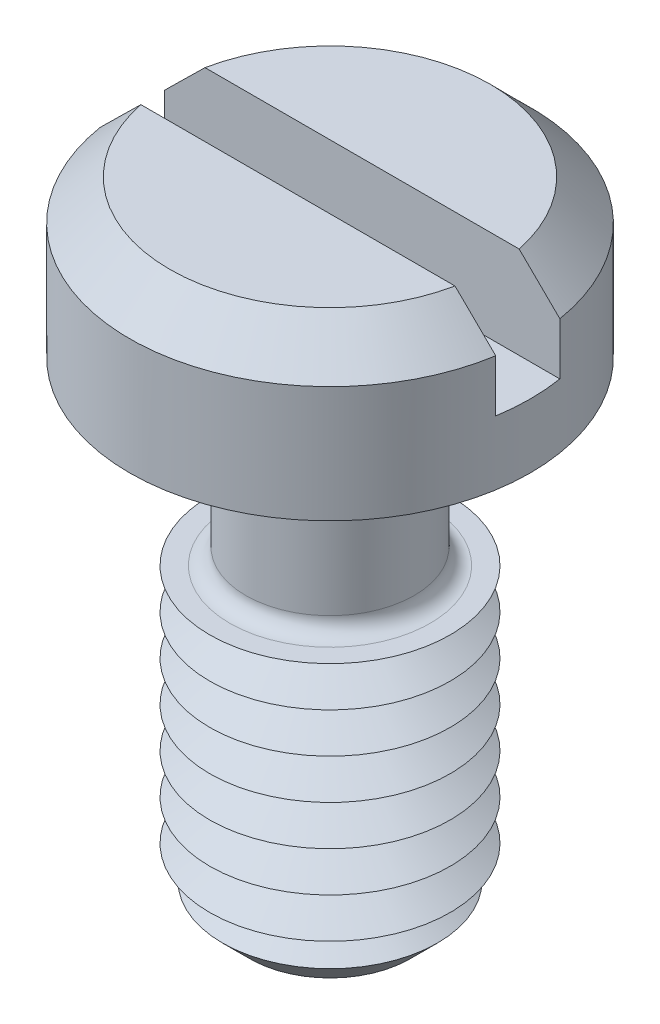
ISO-10303-21;
HEADER;
FILE_DESCRIPTION(('STEP AP214'),'2;1');
FILE_NAME('part.step','',(''),(''),'','','');
FILE_SCHEMA(('AUTOMOTIVE_DESIGN { 1 0 10303 214 1 1 1 1 }'));
ENDSEC;
DATA;
#1=APPLICATION_CONTEXT('core data for automotive mechanical design processes');
#2=APPLICATION_PROTOCOL_DEFINITION('international standard','automotive_design',2000,#1);
#3=PRODUCT_CONTEXT('',#1,'mechanical');
#4=PRODUCT('Part','Part','',(#3));
#5=PRODUCT_RELATED_PRODUCT_CATEGORY('part','',(#4));
#6=PRODUCT_DEFINITION_FORMATION('','',#4);
#7=PRODUCT_DEFINITION_CONTEXT('part definition',#1,'design');
#8=PRODUCT_DEFINITION('design','',#6,#7);
#9=PRODUCT_DEFINITION_SHAPE('','',#8);
#10=(LENGTH_UNIT() NAMED_UNIT(*) SI_UNIT(.MILLI.,.METRE.));
#11=(NAMED_UNIT(*) PLANE_ANGLE_UNIT() SI_UNIT($,.RADIAN.));
#12=(NAMED_UNIT(*) SI_UNIT($,.STERADIAN.) SOLID_ANGLE_UNIT());
#13=UNCERTAINTY_MEASURE_WITH_UNIT(LENGTH_MEASURE(1.E-05),#10,'distance_accuracy_value','');
#14=(GEOMETRIC_REPRESENTATION_CONTEXT(3) GLOBAL_UNCERTAINTY_ASSIGNED_CONTEXT((#13)) GLOBAL_UNIT_ASSIGNED_CONTEXT((#10,
#11,#12)) REPRESENTATION_CONTEXT('',''));
#15=CARTESIAN_POINT('',(0.,0.,0.));
#16=DIRECTION('',(0.,0.,1.));
#17=DIRECTION('',(1.,0.,0.));
#18=AXIS2_PLACEMENT_3D('',#15,#16,#17);
#19=CARTESIAN_POINT('',(0.,3.9,0.));
#20=DIRECTION('',(0.,1.,0.));
#21=DIRECTION('',(0.,0.,1.));
#22=AXIS2_PLACEMENT_3D('',#19,#20,#21);
#23=PLANE('',#22);
#24=DIRECTION('',(-1.,0.,0.));
#25=VECTOR('',#24,1.);
#26=CARTESIAN_POINT('',(5.,3.9,-0.8));
#27=LINE('',#26,#25);
#28=CARTESIAN_POINT('',(3.91918358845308,3.9,-0.8));
#29=VERTEX_POINT('',#28);
#30=CARTESIAN_POINT('',(-3.91918358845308,3.9,-0.8));
#31=VERTEX_POINT('',#30);
#32=EDGE_CURVE('E110',#29,#31,#27,.T.);
#33=ORIENTED_EDGE('',*,*,#32,.F.);
#34=CARTESIAN_POINT('',(0.,3.9,0.));
#35=DIRECTION('',(0.,1.,0.));
#36=DIRECTION('',(0.,0.,1.));
#37=AXIS2_PLACEMENT_3D('',#34,#35,#36);
#38=CIRCLE('',#37,4.);
#39=EDGE_CURVE('E113',#29,#31,#38,.T.);
#40=ORIENTED_EDGE('',*,*,#39,.T.);
#41=EDGE_LOOP('',(#33,#40));
#42=FACE_BOUND('',#41,.T.);
#43=ADVANCED_FACE('F39',(#42),#23,.T.);
#44=CARTESIAN_POINT('',(0.,3.9,0.));
#45=DIRECTION('',(0.,-1.,0.));
#46=DIRECTION('',(0.,0.,-1.));
#47=AXIS2_PLACEMENT_3D('',#44,#45,#46);
#48=CONICAL_SURFACE('',#47,4.,0.785398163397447);
#49=CARTESIAN_POINT('',(11.0010756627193,-3.13012537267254,-0.8));
#50=CARTESIAN_POINT('',(10.6180645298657,-2.74813121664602,-0.8));
#51=CARTESIAN_POINT('',(10.2350087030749,-2.36618183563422,-0.8));
#52=CARTESIAN_POINT('',(9.46873746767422,-1.60241986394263,-0.8));
#53=CARTESIAN_POINT('',(9.08552205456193,-1.22060727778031,-0.8));
#54=CARTESIAN_POINT('',(8.31861292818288,-0.456918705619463,-0.8));
#55=CARTESIAN_POINT('',(7.93491906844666,-0.0750428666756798,-0.8));
#56=CARTESIAN_POINT('',(7.16722555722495,0.688378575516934,-0.8));
#57=CARTESIAN_POINT('',(6.78322591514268,1.06992418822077,-0.8));
#58=CARTESIAN_POINT('',(6.01856215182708,1.82868912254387,-0.8));
#59=CARTESIAN_POINT('',(5.63790309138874,2.20591354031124,-0.8));
#60=CARTESIAN_POINT('',(5.06622054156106,2.7710831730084,-0.8));
#61=CARTESIAN_POINT('',(4.87553531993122,2.9593704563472,-0.8));
#62=CARTESIAN_POINT('',(4.49384424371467,3.33561647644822,-0.8));
#63=CARTESIAN_POINT('',(4.302838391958,3.52357521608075,-0.8));
#64=CARTESIAN_POINT('',(3.92044271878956,3.89893397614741,-0.8));
#65=CARTESIAN_POINT('',(3.7290531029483,4.08633420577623,-0.8));
#66=CARTESIAN_POINT('',(3.34554223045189,4.46039762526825,-0.8));
#67=CARTESIAN_POINT('',(3.15342094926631,4.64706078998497,-0.8));
#68=CARTESIAN_POINT('',(2.76802565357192,5.01913697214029,-0.8));
#69=CARTESIAN_POINT('',(2.57475182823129,5.20455018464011,-0.8));
#70=CARTESIAN_POINT('',(2.28318236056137,5.4809110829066,-0.8));
#71=CARTESIAN_POINT('',(2.1857187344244,5.57273577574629,-0.8));
#72=CARTESIAN_POINT('',(1.98998431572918,5.75552004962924,-0.8));
#73=CARTESIAN_POINT('',(1.89171354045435,5.84647964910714,-0.8));
#74=CARTESIAN_POINT('',(1.76578543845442,5.96147491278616,-0.8));
#75=CARTESIAN_POINT('',(1.73869031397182,5.98612635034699,-0.8));
#76=CARTESIAN_POINT('',(1.68439529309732,6.0353137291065,-0.8));
#77=CARTESIAN_POINT('',(1.65719539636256,6.05984966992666,-0.8));
#78=CARTESIAN_POINT('',(1.57541627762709,6.13326356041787,-0.8));
#79=CARTESIAN_POINT('',(1.52066027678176,6.18194515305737,-0.8));
#80=CARTESIAN_POINT('',(1.41038257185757,6.27874171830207,-0.8));
#81=CARTESIAN_POINT('',(1.35485918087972,6.32685477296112,-0.8));
#82=CARTESIAN_POINT('',(1.24299231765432,6.42210730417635,-0.8));
#83=CARTESIAN_POINT('',(1.18664895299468,6.46924690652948,-0.8));
#84=CARTESIAN_POINT('',(1.07845249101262,6.55754663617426,-0.8));
#85=CARTESIAN_POINT('',(1.02670624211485,6.59883713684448,-0.8));
#86=CARTESIAN_POINT('',(0.921961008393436,6.67979338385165,-0.8));
#87=CARTESIAN_POINT('',(0.868962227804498,6.71945939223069,-0.8));
#88=CARTESIAN_POINT('',(0.761295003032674,6.79630361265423,-0.8));
#89=CARTESIAN_POINT('',(0.706629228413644,6.83348552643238,-0.8));
#90=CARTESIAN_POINT('',(0.594896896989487,6.90399895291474,-0.8));
#91=CARTESIAN_POINT('',(0.5378333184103,6.93733506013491,-0.8));
#92=CARTESIAN_POINT('',(0.428390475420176,6.99356340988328,-0.8));
#93=CARTESIAN_POINT('',(0.376435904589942,7.01726022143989,-0.8));
#94=CARTESIAN_POINT('',(0.269759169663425,7.05717670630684,-0.8));
#95=CARTESIAN_POINT('',(0.215046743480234,7.07342088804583,-0.8));
#96=CARTESIAN_POINT('',(0.113016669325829,7.09332110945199,-0.8));
#97=CARTESIAN_POINT('',(0.066043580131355,7.09866042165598,-0.8));
#98=CARTESIAN_POINT('',(-0.0280587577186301,7.10088875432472,-0.8));
#99=CARTESIAN_POINT('',(-0.0751877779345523,7.09778705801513,-0.8));
#100=CARTESIAN_POINT('',(-0.180723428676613,7.08192474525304,-0.8));
#101=CARTESIAN_POINT('',(-0.238762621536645,7.06679554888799,-0.8));
#102=CARTESIAN_POINT('',(-0.32349937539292,7.03748409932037,-0.8));
#103=CARTESIAN_POINT('',(-0.351441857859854,7.0265659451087,-0.8));
#104=CARTESIAN_POINT('',(-0.40656991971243,7.00295901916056,-0.8));
#105=CARTESIAN_POINT('',(-0.433755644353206,6.99027059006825,-0.8));
#106=CARTESIAN_POINT('',(-0.504673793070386,6.95489235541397,-0.8));
#107=CARTESIAN_POINT('',(-0.547808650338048,6.93101671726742,-0.8));
#108=CARTESIAN_POINT('',(-0.632566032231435,6.88069648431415,-0.8));
#109=CARTESIAN_POINT('',(-0.674187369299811,6.85424992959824,-0.8));
#110=CARTESIAN_POINT('',(-0.756326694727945,6.79950439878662,-0.8));
#111=CARTESIAN_POINT('',(-0.796841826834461,6.77120117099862,-0.8));
#112=CARTESIAN_POINT('',(-0.876938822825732,6.71329852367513,-0.8));
#113=CARTESIAN_POINT('',(-0.916520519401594,6.68369887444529,-0.8));
#114=CARTESIAN_POINT('',(-1.03465904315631,6.59312324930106,-0.8));
#115=CARTESIAN_POINT('',(-1.11211338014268,6.5307142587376,-0.8));
#116=CARTESIAN_POINT('',(-1.26505454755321,6.40381418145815,-0.8));
#117=CARTESIAN_POINT('',(-1.34054439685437,6.33932667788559,-0.8));
#118=CARTESIAN_POINT('',(-1.48913173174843,6.20997083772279,-0.8));
#119=CARTESIAN_POINT('',(-1.5622481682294,6.14512422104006,-0.8));
#120=CARTESIAN_POINT('',(-1.70765393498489,6.01451044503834,-0.8));
#121=CARTESIAN_POINT('',(-1.77994324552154,5.94874326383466,-0.8));
#122=CARTESIAN_POINT('',(-1.99594639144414,5.75046596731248,-0.8));
#123=CARTESIAN_POINT('',(-2.13877767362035,5.61699583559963,-0.8));
#124=CARTESIAN_POINT('',(-2.42324632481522,5.34853800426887,-0.8));
#125=CARTESIAN_POINT('',(-2.56488247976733,5.21354902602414,-0.8));
#126=CARTESIAN_POINT('',(-2.84730929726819,4.94270932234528,-0.8));
#127=CARTESIAN_POINT('',(-2.98810001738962,4.80685865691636,-0.8));
#128=CARTESIAN_POINT('',(-3.26818763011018,4.53549974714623,-0.8));
#129=CARTESIAN_POINT('',(-3.40748821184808,4.39999530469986,-0.8));
#130=CARTESIAN_POINT('',(-3.68570899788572,4.12859172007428,-0.8));
#131=CARTESIAN_POINT('',(-3.82462919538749,3.99269257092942,-0.8));
#132=CARTESIAN_POINT('',(-4.24087543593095,3.58468153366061,-0.8));
#133=CARTESIAN_POINT('',(-4.51779300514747,3.31215310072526,-0.8));
#134=CARTESIAN_POINT('',(-5.05279381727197,2.78443938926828,-0.8));
#135=CARTESIAN_POINT('',(-5.31091639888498,2.52929393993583,-0.8));
#136=CARTESIAN_POINT('',(-5.82680751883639,2.01864429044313,-0.8));
#137=CARTESIAN_POINT('',(-6.08457605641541,1.76314008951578,-0.8));
#138=CARTESIAN_POINT('',(-6.85760508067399,0.996194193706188,-0.8));
#139=CARTESIAN_POINT('',(-7.37251152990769,0.484395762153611,-0.8));
#140=CARTESIAN_POINT('',(-8.40657233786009,-0.544392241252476,-0.8));
#141=CARTESIAN_POINT('',(-8.92572224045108,-1.06138628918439,-0.8));
#142=CARTESIAN_POINT('',(-9.9636287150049,-2.09560660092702,-0.8));
#143=CARTESIAN_POINT('',(-10.4823853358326,-2.61283281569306,-0.8));
#144=CARTESIAN_POINT('',(-11.0010756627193,-3.13012537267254,-0.8));
#145=B_SPLINE_CURVE_WITH_KNOTS('',3,(#49,#50,#51,#52,#53,#54,#55,#56,#57,#58,#59,#60,#61,#62,
#63,#64,#65,#66,#67,#68,#69,#70,#71,#72,#73,#74,#75,#76,#77,#78,#79,#80,#81,#82,#83,#84,#85,#86,
#87,#88,#89,#90,#91,#92,#93,#94,#95,#96,#97,#98,#99,#100,#101,#102,#103,#104,#105,#106,#107,
#108,#109,#110,#111,#112,#113,#114,#115,#116,#117,#118,#119,#120,#121,#122,#123,#124,#125,#126,
#127,#128,#129,#130,#131,#132,#133,#134,#135,#136,#137,#138,#139,#140,#141,#142,#143,#144),
.UNSPECIFIED.,.F.,.F.,(4,2,2,2,2,2,2,2,2,2,2,2,2,2,2,2,2,2,2,2,2,2,2,2,2,2,2,2,2,2,2,2,2,2,2,2,
2,2,2,2,2,2,2,2,2,2,2,4),(0.,1.62282275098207,3.24569489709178,4.86971791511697,
6.49369278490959,8.10142191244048,8.90535980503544,9.7092906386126,10.5128682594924,
11.3164730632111,12.1199494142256,12.5216659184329,12.9233738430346,13.0332669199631,
13.1431603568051,13.3629580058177,13.5833578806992,13.8037290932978,14.0023112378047,
14.2008612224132,14.3991084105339,14.5971162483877,14.7680800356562,14.9384774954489,
15.0795987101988,15.2205647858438,15.3993585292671,15.4893211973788,15.579266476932,
15.727032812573,15.8749126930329,16.0231439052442,16.1714014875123,16.4697244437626,
16.767558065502,17.0607348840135,17.35391868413,17.9403574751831,18.5273336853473,
19.1142694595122,19.6972736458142,20.2802881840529,21.4458742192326,22.5346981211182,
23.6235243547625,25.8015035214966,27.9995014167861,30.1971550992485),.UNSPECIFIED.);
#146=CARTESIAN_POINT('',(4.93558507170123,2.9,-0.8));
#147=VERTEX_POINT('',#146);
#148=EDGE_CURVE('E250',#147,#29,#145,.T.);
#149=ORIENTED_EDGE('',*,*,#148,.F.);
#150=CARTESIAN_POINT('',(0.,2.9,0.));
#151=DIRECTION('',(0.,1.,0.));
#152=DIRECTION('',(0.,0.,1.));
#153=AXIS2_PLACEMENT_3D('',#150,#151,#152);
#154=CIRCLE('',#153,5.);
#155=CARTESIAN_POINT('',(-4.93558507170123,2.9,-0.8));
#156=VERTEX_POINT('',#155);
#157=EDGE_CURVE('E126',#156,#147,#154,.F.);
#158=ORIENTED_EDGE('',*,*,#157,.F.);
#159=EDGE_CURVE('E102',#31,#156,#145,.T.);
#160=ORIENTED_EDGE('',*,*,#159,.F.);
#161=ORIENTED_EDGE('',*,*,#39,.F.);
#162=EDGE_LOOP('',(#149,#158,#160,#161));
#163=FACE_BOUND('',#162,.T.);
#164=ADVANCED_FACE('F212',(#163),#48,.T.);
#165=CARTESIAN_POINT('',(0.,-12.,0.));
#166=DIRECTION('',(0.,1.,0.));
#167=DIRECTION('',(0.,0.,1.));
#168=AXIS2_PLACEMENT_3D('',#165,#166,#167);
#169=CYLINDRICAL_SURFACE('',#168,2.1);
#170=CARTESIAN_POINT('',(0.,-4.1,0.));
#171=DIRECTION('',(0.,-1.,0.));
#172=DIRECTION('',(0.,0.,-1.));
#173=AXIS2_PLACEMENT_3D('',#170,#171,#172);
#174=CIRCLE('',#173,2.1);
#175=CARTESIAN_POINT('',(0.,-4.1,-2.1));
#176=VERTEX_POINT('',#175);
#177=EDGE_CURVE('E121',#176,#176,#174,.F.);
#178=ORIENTED_EDGE('',*,*,#177,.T.);
#179=EDGE_LOOP('',(#178));
#180=FACE_BOUND('',#179,.T.);
#181=CARTESIAN_POINT('',(0.,-0.399999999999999,0.));
#182=DIRECTION('',(0.,1.,0.));
#183=DIRECTION('',(0.,0.,1.));
#184=AXIS2_PLACEMENT_3D('',#181,#182,#183);
#185=CIRCLE('',#184,2.1);
#186=CARTESIAN_POINT('',(0.,-0.399999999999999,2.1));
#187=VERTEX_POINT('',#186);
#188=EDGE_CURVE('E349',#187,#187,#185,.F.);
#189=ORIENTED_EDGE('',*,*,#188,.T.);
#190=EDGE_LOOP('',(#189));
#191=FACE_BOUND('',#190,.T.);
#192=ADVANCED_FACE('F208',(#180,#191),#169,.T.);
#193=CARTESIAN_POINT('',(0.,3.9,0.));
#194=DIRECTION('',(0.,-1.,0.));
#195=DIRECTION('',(0.,0.,-1.));
#196=AXIS2_PLACEMENT_3D('',#193,#194,#195);
#197=CYLINDRICAL_SURFACE('',#196,5.);
#198=ORIENTED_EDGE('',*,*,#157,.T.);
#199=DIRECTION('',(0.,-1.,0.));
#200=VECTOR('',#199,1.);
#201=CARTESIAN_POINT('',(4.93558507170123,3.9,-0.8));
#202=LINE('',#201,#200);
#203=CARTESIAN_POINT('',(4.93558507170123,1.6,-0.8));
#204=VERTEX_POINT('',#203);
#205=EDGE_CURVE('E64',#147,#204,#202,.T.);
#206=ORIENTED_EDGE('',*,*,#205,.T.);
#207=CARTESIAN_POINT('',(0.,1.6,0.));
#208=DIRECTION('',(0.,1.,0.));
#209=DIRECTION('',(0.,0.,1.));
#210=AXIS2_PLACEMENT_3D('',#207,#208,#209);
#211=CIRCLE('',#210,5.);
#212=CARTESIAN_POINT('',(4.93558507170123,1.6,0.8));
#213=VERTEX_POINT('',#212);
#214=EDGE_CURVE('E11',#213,#204,#211,.T.);
#215=ORIENTED_EDGE('',*,*,#214,.F.);
#216=DIRECTION('',(0.,-1.,0.));
#217=VECTOR('',#216,1.);
#218=CARTESIAN_POINT('',(4.93558507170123,3.9,0.8));
#219=LINE('',#218,#217);
#220=CARTESIAN_POINT('',(4.93558507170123,2.9,0.8));
#221=VERTEX_POINT('',#220);
#222=EDGE_CURVE('E269',#213,#221,#219,.F.);
#223=ORIENTED_EDGE('',*,*,#222,.T.);
#224=CARTESIAN_POINT('',(-4.93558507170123,2.9,0.8));
#225=VERTEX_POINT('',#224);
#226=EDGE_CURVE('E119',#221,#225,#154,.F.);
#227=ORIENTED_EDGE('',*,*,#226,.T.);
#228=DIRECTION('',(0.,-1.,0.));
#229=VECTOR('',#228,1.);
#230=CARTESIAN_POINT('',(-4.93558507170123,3.9,0.8));
#231=LINE('',#230,#229);
#232=CARTESIAN_POINT('',(-4.93558507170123,1.6,0.8));
#233=VERTEX_POINT('',#232);
#234=EDGE_CURVE('E96',#225,#233,#231,.T.);
#235=ORIENTED_EDGE('',*,*,#234,.T.);
#236=CARTESIAN_POINT('',(-4.93558507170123,1.6,-0.8));
#237=VERTEX_POINT('',#236);
#238=EDGE_CURVE('E44',#237,#233,#211,.T.);
#239=ORIENTED_EDGE('',*,*,#238,.F.);
#240=DIRECTION('',(0.,-1.,0.));
#241=VECTOR('',#240,1.);
#242=CARTESIAN_POINT('',(-4.93558507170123,3.9,-0.8));
#243=LINE('',#242,#241);
#244=EDGE_CURVE('E274',#237,#156,#243,.F.);
#245=ORIENTED_EDGE('',*,*,#244,.T.);
#246=EDGE_LOOP('',(#198,#206,#215,#223,#227,#235,#239,#245));
#247=FACE_BOUND('',#246,.T.);
#248=CARTESIAN_POINT('',(0.,0.,0.));
#249=DIRECTION('',(0.,1.,0.));
#250=DIRECTION('',(0.,0.,1.));
#251=AXIS2_PLACEMENT_3D('',#248,#249,#250);
#252=CIRCLE('',#251,5.);
#253=CARTESIAN_POINT('',(0.,0.,5.));
#254=VERTEX_POINT('',#253);
#255=EDGE_CURVE('E335',#254,#254,#252,.T.);
#256=ORIENTED_EDGE('',*,*,#255,.T.);
#257=EDGE_LOOP('',(#256));
#258=FACE_BOUND('',#257,.T.);
#259=ADVANCED_FACE('F211',(#247,#258),#197,.T.);
#260=DIRECTION('',(1.,0.,0.));
#261=VECTOR('',#260,1.);
#262=CARTESIAN_POINT('',(5.,3.9,0.8));
#263=LINE('',#262,#261);
#264=CARTESIAN_POINT('',(-3.91918358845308,3.9,0.8));
#265=VERTEX_POINT('',#264);
#266=CARTESIAN_POINT('',(3.91918358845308,3.9,0.8));
#267=VERTEX_POINT('',#266);
#268=EDGE_CURVE('E56',#265,#267,#263,.T.);
#269=ORIENTED_EDGE('',*,*,#268,.F.);
#270=EDGE_CURVE('E108',#265,#267,#38,.T.);
#271=ORIENTED_EDGE('',*,*,#270,.T.);
#272=EDGE_LOOP('',(#269,#271));
#273=FACE_BOUND('',#272,.T.);
#274=ADVANCED_FACE('F107',(#273),#23,.T.);
#275=CARTESIAN_POINT('',(0.,0.,0.));
#276=DIRECTION('',(0.,1.,0.));
#277=DIRECTION('',(0.,0.,1.));
#278=AXIS2_PLACEMENT_3D('',#275,#276,#277);
#279=PLANE('',#278);
#280=CARTESIAN_POINT('',(0.,0.,0.));
#281=DIRECTION('',(0.,1.,0.));
#282=DIRECTION('',(0.,0.,1.));
#283=AXIS2_PLACEMENT_3D('',#280,#281,#282);
#284=CIRCLE('',#283,2.5);
#285=CARTESIAN_POINT('',(0.,0.,2.5));
#286=VERTEX_POINT('',#285);
#287=EDGE_CURVE('E114',#286,#286,#284,.T.);
#288=ORIENTED_EDGE('',*,*,#287,.T.);
#289=EDGE_LOOP('',(#288));
#290=FACE_BOUND('',#289,.T.);
#291=ORIENTED_EDGE('',*,*,#255,.F.);
#292=EDGE_LOOP('',(#291));
#293=FACE_BOUND('',#292,.T.);
#294=ADVANCED_FACE('F202',(#290,#293),#279,.F.);
#295=CARTESIAN_POINT('',(0.,-4.5,0.));
#296=DIRECTION('',(0.,-1.,0.));
#297=DIRECTION('',(0.,0.,-1.));
#298=AXIS2_PLACEMENT_3D('',#295,#296,#297);
#299=PLANE('',#298);
#300=CARTESIAN_POINT('',(0.,-4.5,0.));
#301=DIRECTION('',(0.,-1.,0.));
#302=DIRECTION('',(0.,0.,-1.));
#303=AXIS2_PLACEMENT_3D('',#300,#301,#302);
#304=CIRCLE('',#303,2.5);
#305=CARTESIAN_POINT('',(0.,-4.5,-2.5));
#306=VERTEX_POINT('',#305);
#307=EDGE_CURVE('E343',#306,#306,#304,.T.);
#308=ORIENTED_EDGE('',*,*,#307,.T.);
#309=EDGE_LOOP('',(#308));
#310=FACE_BOUND('',#309,.T.);
#311=CARTESIAN_POINT('',(0.,-4.5,0.));
#312=DIRECTION('',(0.,1.,0.));
#313=DIRECTION('',(0.,0.,1.));
#314=AXIS2_PLACEMENT_3D('',#311,#312,#313);
#315=CIRCLE('',#314,3.);
#316=CARTESIAN_POINT('',(0.,-4.5,3.));
#317=VERTEX_POINT('',#316);
#318=EDGE_CURVE('E331',#317,#317,#315,.T.);
#319=ORIENTED_EDGE('',*,*,#318,.T.);
#320=EDGE_LOOP('',(#319));
#321=FACE_BOUND('',#320,.T.);
#322=ADVANCED_FACE('F198',(#310,#321),#299,.F.);
#323=CARTESIAN_POINT('',(0.,-5.,0.));
#324=DIRECTION('',(0.,1.,0.));
#325=DIRECTION('',(0.,0.,1.));
#326=AXIS2_PLACEMENT_3D('',#323,#324,#325);
#327=CONICAL_SURFACE('',#326,2.13397459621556,1.0471975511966);
#328=ORIENTED_EDGE('',*,*,#318,.F.);
#329=EDGE_LOOP('',(#328));
#330=FACE_BOUND('',#329,.T.);
#331=CARTESIAN_POINT('',(0.,-5.,0.));
#332=DIRECTION('',(0.,1.,0.));
#333=DIRECTION('',(0.,0.,1.));
#334=AXIS2_PLACEMENT_3D('',#331,#332,#333);
#335=CIRCLE('',#334,2.13397459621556);
#336=CARTESIAN_POINT('',(0.,-5.,2.13397459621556));
#337=VERTEX_POINT('',#336);
#338=EDGE_CURVE('E327',#337,#337,#335,.T.);
#339=ORIENTED_EDGE('',*,*,#338,.T.);
#340=EDGE_LOOP('',(#339));
#341=FACE_BOUND('',#340,.T.);
#342=ADVANCED_FACE('F194',(#330,#341),#327,.T.);
#343=CARTESIAN_POINT('',(0.,-5.5,0.));
#344=DIRECTION('',(0.,-1.,0.));
#345=DIRECTION('',(0.,0.,-1.));
#346=AXIS2_PLACEMENT_3D('',#343,#344,#345);
#347=CONICAL_SURFACE('',#346,3.,1.0471975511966);
#348=ORIENTED_EDGE('',*,*,#338,.F.);
#349=EDGE_LOOP('',(#348));
#350=FACE_BOUND('',#349,.T.);
#351=CARTESIAN_POINT('',(0.,-5.5,0.));
#352=DIRECTION('',(0.,1.,0.));
#353=DIRECTION('',(0.,0.,1.));
#354=AXIS2_PLACEMENT_3D('',#351,#352,#353);
#355=CIRCLE('',#354,3.);
#356=CARTESIAN_POINT('',(0.,-5.5,3.));
#357=VERTEX_POINT('',#356);
#358=EDGE_CURVE('E324',#357,#357,#355,.T.);
#359=ORIENTED_EDGE('',*,*,#358,.T.);
#360=EDGE_LOOP('',(#359));
#361=FACE_BOUND('',#360,.T.);
#362=ADVANCED_FACE('F190',(#350,#361),#347,.T.);
#363=CARTESIAN_POINT('',(0.,-6.,0.));
#364=DIRECTION('',(0.,1.,0.));
#365=DIRECTION('',(0.,0.,1.));
#366=AXIS2_PLACEMENT_3D('',#363,#364,#365);
#367=CONICAL_SURFACE('',#366,2.13397459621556,1.0471975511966);
#368=ORIENTED_EDGE('',*,*,#358,.F.);
#369=EDGE_LOOP('',(#368));
#370=FACE_BOUND('',#369,.T.);
#371=CARTESIAN_POINT('',(0.,-6.,0.));
#372=DIRECTION('',(0.,1.,0.));
#373=DIRECTION('',(0.,0.,1.));
#374=AXIS2_PLACEMENT_3D('',#371,#372,#373);
#375=CIRCLE('',#374,2.13397459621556);
#376=CARTESIAN_POINT('',(0.,-6.,2.13397459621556));
#377=VERTEX_POINT('',#376);
#378=EDGE_CURVE('E320',#377,#377,#375,.T.);
#379=ORIENTED_EDGE('',*,*,#378,.T.);
#380=EDGE_LOOP('',(#379));
#381=FACE_BOUND('',#380,.T.);
#382=ADVANCED_FACE('F186',(#370,#381),#367,.T.);
#383=CARTESIAN_POINT('',(0.,-6.5,0.));
#384=DIRECTION('',(0.,-1.,0.));
#385=DIRECTION('',(0.,0.,-1.));
#386=AXIS2_PLACEMENT_3D('',#383,#384,#385);
#387=CONICAL_SURFACE('',#386,3.,1.0471975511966);
#388=ORIENTED_EDGE('',*,*,#378,.F.);
#389=EDGE_LOOP('',(#388));
#390=FACE_BOUND('',#389,.T.);
#391=CARTESIAN_POINT('',(0.,-6.5,0.));
#392=DIRECTION('',(0.,1.,0.));
#393=DIRECTION('',(0.,0.,1.));
#394=AXIS2_PLACEMENT_3D('',#391,#392,#393);
#395=CIRCLE('',#394,3.);
#396=CARTESIAN_POINT('',(0.,-6.5,3.));
#397=VERTEX_POINT('',#396);
#398=EDGE_CURVE('E316',#397,#397,#395,.T.);
#399=ORIENTED_EDGE('',*,*,#398,.T.);
#400=EDGE_LOOP('',(#399));
#401=FACE_BOUND('',#400,.T.);
#402=ADVANCED_FACE('F182',(#390,#401),#387,.T.);
#403=CARTESIAN_POINT('',(0.,-7.,0.));
#404=DIRECTION('',(0.,1.,0.));
#405=DIRECTION('',(0.,0.,1.));
#406=AXIS2_PLACEMENT_3D('',#403,#404,#405);
#407=CONICAL_SURFACE('',#406,2.13397459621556,1.0471975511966);
#408=ORIENTED_EDGE('',*,*,#398,.F.);
#409=EDGE_LOOP('',(#408));
#410=FACE_BOUND('',#409,.T.);
#411=CARTESIAN_POINT('',(0.,-7.,0.));
#412=DIRECTION('',(0.,1.,0.));
#413=DIRECTION('',(0.,0.,1.));
#414=AXIS2_PLACEMENT_3D('',#411,#412,#413);
#415=CIRCLE('',#414,2.13397459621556);
#416=CARTESIAN_POINT('',(0.,-7.,2.13397459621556));
#417=VERTEX_POINT('',#416);
#418=EDGE_CURVE('E313',#417,#417,#415,.T.);
#419=ORIENTED_EDGE('',*,*,#418,.T.);
#420=EDGE_LOOP('',(#419));
#421=FACE_BOUND('',#420,.T.);
#422=ADVANCED_FACE('F178',(#410,#421),#407,.T.);
#423=CARTESIAN_POINT('',(0.,-7.5,0.));
#424=DIRECTION('',(0.,-1.,0.));
#425=DIRECTION('',(0.,0.,-1.));
#426=AXIS2_PLACEMENT_3D('',#423,#424,#425);
#427=CONICAL_SURFACE('',#426,3.,1.0471975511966);
#428=ORIENTED_EDGE('',*,*,#418,.F.);
#429=EDGE_LOOP('',(#428));
#430=FACE_BOUND('',#429,.T.);
#431=CARTESIAN_POINT('',(0.,-7.5,0.));
#432=DIRECTION('',(0.,1.,0.));
#433=DIRECTION('',(0.,0.,1.));
#434=AXIS2_PLACEMENT_3D('',#431,#432,#433);
#435=CIRCLE('',#434,3.);
#436=CARTESIAN_POINT('',(0.,-7.5,3.));
#437=VERTEX_POINT('',#436);
#438=EDGE_CURVE('E309',#437,#437,#435,.T.);
#439=ORIENTED_EDGE('',*,*,#438,.T.);
#440=EDGE_LOOP('',(#439));
#441=FACE_BOUND('',#440,.T.);
#442=ADVANCED_FACE('F174',(#430,#441),#427,.T.);
#443=CARTESIAN_POINT('',(0.,-8.,0.));
#444=DIRECTION('',(0.,1.,0.));
#445=DIRECTION('',(0.,0.,1.));
#446=AXIS2_PLACEMENT_3D('',#443,#444,#445);
#447=CONICAL_SURFACE('',#446,2.13397459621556,1.0471975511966);
#448=ORIENTED_EDGE('',*,*,#438,.F.);
#449=EDGE_LOOP('',(#448));
#450=FACE_BOUND('',#449,.T.);
#451=CARTESIAN_POINT('',(0.,-8.,0.));
#452=DIRECTION('',(0.,1.,0.));
#453=DIRECTION('',(0.,0.,1.));
#454=AXIS2_PLACEMENT_3D('',#451,#452,#453);
#455=CIRCLE('',#454,2.13397459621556);
#456=CARTESIAN_POINT('',(0.,-8.,2.13397459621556));
#457=VERTEX_POINT('',#456);
#458=EDGE_CURVE('E305',#457,#457,#455,.T.);
#459=ORIENTED_EDGE('',*,*,#458,.T.);
#460=EDGE_LOOP('',(#459));
#461=FACE_BOUND('',#460,.T.);
#462=ADVANCED_FACE('F170',(#450,#461),#447,.T.);
#463=CARTESIAN_POINT('',(0.,-8.5,0.));
#464=DIRECTION('',(0.,-1.,0.));
#465=DIRECTION('',(0.,0.,-1.));
#466=AXIS2_PLACEMENT_3D('',#463,#464,#465);
#467=CONICAL_SURFACE('',#466,3.,1.0471975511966);
#468=ORIENTED_EDGE('',*,*,#458,.F.);
#469=EDGE_LOOP('',(#468));
#470=FACE_BOUND('',#469,.T.);
#471=CARTESIAN_POINT('',(0.,-8.5,0.));
#472=DIRECTION('',(0.,1.,0.));
#473=DIRECTION('',(0.,0.,1.));
#474=AXIS2_PLACEMENT_3D('',#471,#472,#473);
#475=CIRCLE('',#474,3.);
#476=CARTESIAN_POINT('',(0.,-8.5,3.));
#477=VERTEX_POINT('',#476);
#478=EDGE_CURVE('E301',#477,#477,#475,.T.);
#479=ORIENTED_EDGE('',*,*,#478,.T.);
#480=EDGE_LOOP('',(#479));
#481=FACE_BOUND('',#480,.T.);
#482=ADVANCED_FACE('F166',(#470,#481),#467,.T.);
#483=CARTESIAN_POINT('',(0.,-9.,0.));
#484=DIRECTION('',(0.,1.,0.));
#485=DIRECTION('',(0.,0.,1.));
#486=AXIS2_PLACEMENT_3D('',#483,#484,#485);
#487=CONICAL_SURFACE('',#486,2.13397459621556,1.0471975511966);
#488=ORIENTED_EDGE('',*,*,#478,.F.);
#489=EDGE_LOOP('',(#488));
#490=FACE_BOUND('',#489,.T.);
#491=CARTESIAN_POINT('',(0.,-9.,0.));
#492=DIRECTION('',(0.,1.,0.));
#493=DIRECTION('',(0.,0.,1.));
#494=AXIS2_PLACEMENT_3D('',#491,#492,#493);
#495=CIRCLE('',#494,2.13397459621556);
#496=CARTESIAN_POINT('',(0.,-9.,2.13397459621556));
#497=VERTEX_POINT('',#496);
#498=EDGE_CURVE('E297',#497,#497,#495,.T.);
#499=ORIENTED_EDGE('',*,*,#498,.T.);
#500=EDGE_LOOP('',(#499));
#501=FACE_BOUND('',#500,.T.);
#502=ADVANCED_FACE('F162',(#490,#501),#487,.T.);
#503=CARTESIAN_POINT('',(0.,-9.5,0.));
#504=DIRECTION('',(0.,-1.,0.));
#505=DIRECTION('',(0.,0.,-1.));
#506=AXIS2_PLACEMENT_3D('',#503,#504,#505);
#507=CONICAL_SURFACE('',#506,3.,1.0471975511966);
#508=ORIENTED_EDGE('',*,*,#498,.F.);
#509=EDGE_LOOP('',(#508));
#510=FACE_BOUND('',#509,.T.);
#511=CARTESIAN_POINT('',(0.,-9.5,0.));
#512=DIRECTION('',(0.,1.,0.));
#513=DIRECTION('',(0.,0.,1.));
#514=AXIS2_PLACEMENT_3D('',#511,#512,#513);
#515=CIRCLE('',#514,3.);
#516=CARTESIAN_POINT('',(0.,-9.5,3.));
#517=VERTEX_POINT('',#516);
#518=EDGE_CURVE('E293',#517,#517,#515,.T.);
#519=ORIENTED_EDGE('',*,*,#518,.T.);
#520=EDGE_LOOP('',(#519));
#521=FACE_BOUND('',#520,.T.);
#522=ADVANCED_FACE('F158',(#510,#521),#507,.T.);
#523=CARTESIAN_POINT('',(0.,-10.,0.));
#524=DIRECTION('',(0.,1.,0.));
#525=DIRECTION('',(0.,0.,1.));
#526=AXIS2_PLACEMENT_3D('',#523,#524,#525);
#527=CONICAL_SURFACE('',#526,2.13397459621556,1.0471975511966);
#528=ORIENTED_EDGE('',*,*,#518,.F.);
#529=EDGE_LOOP('',(#528));
#530=FACE_BOUND('',#529,.T.);
#531=CARTESIAN_POINT('',(0.,-10.,0.));
#532=DIRECTION('',(0.,1.,0.));
#533=DIRECTION('',(0.,0.,1.));
#534=AXIS2_PLACEMENT_3D('',#531,#532,#533);
#535=CIRCLE('',#534,2.13397459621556);
#536=CARTESIAN_POINT('',(0.,-10.,2.13397459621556));
#537=VERTEX_POINT('',#536);
#538=EDGE_CURVE('E290',#537,#537,#535,.T.);
#539=ORIENTED_EDGE('',*,*,#538,.T.);
#540=EDGE_LOOP('',(#539));
#541=FACE_BOUND('',#540,.T.);
#542=ADVANCED_FACE('F154',(#530,#541),#527,.T.);
#543=CARTESIAN_POINT('',(0.,-10.5,0.));
#544=DIRECTION('',(0.,-1.,0.));
#545=DIRECTION('',(0.,0.,-1.));
#546=AXIS2_PLACEMENT_3D('',#543,#544,#545);
#547=CONICAL_SURFACE('',#546,3.,1.0471975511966);
#548=ORIENTED_EDGE('',*,*,#538,.F.);
#549=EDGE_LOOP('',(#548));
#550=FACE_BOUND('',#549,.T.);
#551=CARTESIAN_POINT('',(0.,-10.5,0.));
#552=DIRECTION('',(0.,1.,0.));
#553=DIRECTION('',(0.,0.,1.));
#554=AXIS2_PLACEMENT_3D('',#551,#552,#553);
#555=CIRCLE('',#554,3.);
#556=CARTESIAN_POINT('',(0.,-10.5,3.));
#557=VERTEX_POINT('',#556);
#558=EDGE_CURVE('E286',#557,#557,#555,.T.);
#559=ORIENTED_EDGE('',*,*,#558,.T.);
#560=EDGE_LOOP('',(#559));
#561=FACE_BOUND('',#560,.T.);
#562=ADVANCED_FACE('F150',(#550,#561),#547,.T.);
#563=CARTESIAN_POINT('',(0.,-11.,0.));
#564=DIRECTION('',(0.,1.,0.));
#565=DIRECTION('',(0.,0.,1.));
#566=AXIS2_PLACEMENT_3D('',#563,#564,#565);
#567=CONICAL_SURFACE('',#566,2.13397459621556,1.0471975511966);
#568=ORIENTED_EDGE('',*,*,#558,.F.);
#569=EDGE_LOOP('',(#568));
#570=FACE_BOUND('',#569,.T.);
#571=CARTESIAN_POINT('',(0.,-11.,0.));
#572=DIRECTION('',(0.,1.,0.));
#573=DIRECTION('',(0.,0.,1.));
#574=AXIS2_PLACEMENT_3D('',#571,#572,#573);
#575=CIRCLE('',#574,2.13397459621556);
#576=CARTESIAN_POINT('',(0.,-11.,2.13397459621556));
#577=VERTEX_POINT('',#576);
#578=EDGE_CURVE('E283',#577,#577,#575,.T.);
#579=ORIENTED_EDGE('',*,*,#578,.T.);
#580=EDGE_LOOP('',(#579));
#581=FACE_BOUND('',#580,.T.);
#582=ADVANCED_FACE('F146',(#570,#581),#567,.T.);
#583=CARTESIAN_POINT('',(0.,-11.5,0.));
#584=DIRECTION('',(0.,-1.,0.));
#585=DIRECTION('',(0.,0.,-1.));
#586=AXIS2_PLACEMENT_3D('',#583,#584,#585);
#587=CONICAL_SURFACE('',#586,3.,1.0471975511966);
#588=CARTESIAN_POINT('',(0.,-11.3169872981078,0.));
#589=DIRECTION('',(0.,-1.,0.));
#590=DIRECTION('',(0.,0.,-1.));
#591=AXIS2_PLACEMENT_3D('',#588,#589,#590);
#592=CIRCLE('',#591,2.68301270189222);
#593=CARTESIAN_POINT('',(0.,-11.3169872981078,-2.68301270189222));
#594=VERTEX_POINT('',#593);
#595=EDGE_CURVE('E289',#594,#594,#592,.F.);
#596=ORIENTED_EDGE('',*,*,#595,.T.);
#597=EDGE_LOOP('',(#596));
#598=FACE_BOUND('',#597,.T.);
#599=ORIENTED_EDGE('',*,*,#578,.F.);
#600=EDGE_LOOP('',(#599));
#601=FACE_BOUND('',#600,.T.);
#602=ADVANCED_FACE('F142',(#598,#601),#587,.T.);
#603=CARTESIAN_POINT('',(0.,-12.,0.));
#604=DIRECTION('',(0.,-1.,0.));
#605=DIRECTION('',(0.,0.,-1.));
#606=AXIS2_PLACEMENT_3D('',#603,#604,#605);
#607=PLANE('',#606);
#608=CARTESIAN_POINT('',(0.,-12.,0.));
#609=DIRECTION('',(0.,-1.,0.));
#610=DIRECTION('',(0.,0.,-1.));
#611=AXIS2_PLACEMENT_3D('',#608,#609,#610);
#612=CIRCLE('',#611,2.);
#613=CARTESIAN_POINT('',(0.,-12.,-2.));
#614=VERTEX_POINT('',#613);
#615=EDGE_CURVE('E339',#614,#614,#612,.T.);
#616=ORIENTED_EDGE('',*,*,#615,.T.);
#617=EDGE_LOOP('',(#616));
#618=FACE_BOUND('',#617,.T.);
#619=ADVANCED_FACE('F145',(#618),#607,.T.);
#620=CARTESIAN_POINT('',(0.,-12.,0.));
#621=DIRECTION('',(0.,1.,0.));
#622=DIRECTION('',(0.,0.,1.));
#623=AXIS2_PLACEMENT_3D('',#620,#621,#622);
#624=CONICAL_SURFACE('',#623,2.,0.785398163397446);
#625=ORIENTED_EDGE('',*,*,#595,.F.);
#626=EDGE_LOOP('',(#625));
#627=FACE_BOUND('',#626,.T.);
#628=ORIENTED_EDGE('',*,*,#615,.F.);
#629=EDGE_LOOP('',(#628));
#630=FACE_BOUND('',#629,.T.);
#631=ADVANCED_FACE('F206',(#627,#630),#624,.T.);
#632=CARTESIAN_POINT('',(0.,-4.1,0.));
#633=DIRECTION('',(0.,-1.,0.));
#634=DIRECTION('',(0.,0.,-1.));
#635=AXIS2_PLACEMENT_3D('',#632,#633,#634);
#636=TOROIDAL_SURFACE('',#635,2.5,0.4);
#637=ORIENTED_EDGE('',*,*,#177,.F.);
#638=EDGE_LOOP('',(#637));
#639=FACE_BOUND('',#638,.T.);
#640=ORIENTED_EDGE('',*,*,#307,.F.);
#641=EDGE_LOOP('',(#640));
#642=FACE_BOUND('',#641,.T.);
#643=ADVANCED_FACE('F224',(#639,#642),#636,.F.);
#644=CARTESIAN_POINT('',(0.,-0.399999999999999,0.));
#645=DIRECTION('',(0.,1.,0.));
#646=DIRECTION('',(0.,0.,1.));
#647=AXIS2_PLACEMENT_3D('',#644,#645,#646);
#648=TOROIDAL_SURFACE('',#647,2.5,0.4);
#649=ORIENTED_EDGE('',*,*,#287,.F.);
#650=EDGE_LOOP('',(#649));
#651=FACE_BOUND('',#650,.T.);
#652=ORIENTED_EDGE('',*,*,#188,.F.);
#653=EDGE_LOOP('',(#652));
#654=FACE_BOUND('',#653,.T.);
#655=ADVANCED_FACE('F227',(#651,#654),#648,.F.);
#656=CARTESIAN_POINT('',(-11.0010756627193,-3.13012537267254,0.8));
#657=CARTESIAN_POINT('',(-10.6180645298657,-2.74813121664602,0.8));
#658=CARTESIAN_POINT('',(-10.2350087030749,-2.36618183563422,0.8));
#659=CARTESIAN_POINT('',(-9.46873746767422,-1.60241986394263,0.8));
#660=CARTESIAN_POINT('',(-9.08552205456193,-1.22060727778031,0.8));
#661=CARTESIAN_POINT('',(-8.31861292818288,-0.456918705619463,0.8));
#662=CARTESIAN_POINT('',(-7.93491906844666,-0.0750428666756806,0.8));
#663=CARTESIAN_POINT('',(-7.16722555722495,0.688378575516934,0.8));
#664=CARTESIAN_POINT('',(-6.78322591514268,1.06992418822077,0.8));
#665=CARTESIAN_POINT('',(-6.01856215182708,1.82868912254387,0.8));
#666=CARTESIAN_POINT('',(-5.63790309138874,2.20591354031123,0.8));
#667=CARTESIAN_POINT('',(-5.06622054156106,2.7710831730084,0.8));
#668=CARTESIAN_POINT('',(-4.87553531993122,2.9593704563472,0.8));
#669=CARTESIAN_POINT('',(-4.49384424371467,3.33561647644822,0.8));
#670=CARTESIAN_POINT('',(-4.30283839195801,3.52357521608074,0.8));
#671=CARTESIAN_POINT('',(-3.92044271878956,3.89893397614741,0.8));
#672=CARTESIAN_POINT('',(-3.72905310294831,4.08633420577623,0.8));
#673=CARTESIAN_POINT('',(-3.34554223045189,4.46039762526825,0.8));
#674=CARTESIAN_POINT('',(-3.15342094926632,4.64706078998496,0.8));
#675=CARTESIAN_POINT('',(-2.76802565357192,5.01913697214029,0.8));
#676=CARTESIAN_POINT('',(-2.57475182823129,5.2045501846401,0.8));
#677=CARTESIAN_POINT('',(-2.28318236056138,5.4809110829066,0.8));
#678=CARTESIAN_POINT('',(-2.1857187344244,5.57273577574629,0.8));
#679=CARTESIAN_POINT('',(-1.98998431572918,5.75552004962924,0.8));
#680=CARTESIAN_POINT('',(-1.89171354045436,5.84647964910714,0.8));
#681=CARTESIAN_POINT('',(-1.76578543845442,5.96147491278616,0.8));
#682=CARTESIAN_POINT('',(-1.73869031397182,5.98612635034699,0.8));
#683=CARTESIAN_POINT('',(-1.68439529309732,6.0353137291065,0.8));
#684=CARTESIAN_POINT('',(-1.65719539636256,6.05984966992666,0.8));
#685=CARTESIAN_POINT('',(-1.5754162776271,6.13326356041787,0.8));
#686=CARTESIAN_POINT('',(-1.52066027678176,6.18194515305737,0.8));
#687=CARTESIAN_POINT('',(-1.41038257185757,6.27874171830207,0.8));
#688=CARTESIAN_POINT('',(-1.35485918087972,6.32685477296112,0.8));
#689=CARTESIAN_POINT('',(-1.24299231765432,6.42210730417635,0.8));
#690=CARTESIAN_POINT('',(-1.18664895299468,6.46924690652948,0.8));
#691=CARTESIAN_POINT('',(-1.07845249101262,6.55754663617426,0.8));
#692=CARTESIAN_POINT('',(-1.02670624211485,6.59883713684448,0.8));
#693=CARTESIAN_POINT('',(-0.921961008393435,6.67979338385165,0.8));
#694=CARTESIAN_POINT('',(-0.868962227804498,6.71945939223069,0.8));
#695=CARTESIAN_POINT('',(-0.761295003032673,6.79630361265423,0.8));
#696=CARTESIAN_POINT('',(-0.706629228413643,6.83348552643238,0.8));
#697=CARTESIAN_POINT('',(-0.594896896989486,6.90399895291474,0.8));
#698=CARTESIAN_POINT('',(-0.537833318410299,6.93733506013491,0.8));
#699=CARTESIAN_POINT('',(-0.428390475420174,6.99356340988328,0.8));
#700=CARTESIAN_POINT('',(-0.37643590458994,7.01726022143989,0.8));
#701=CARTESIAN_POINT('',(-0.269759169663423,7.05717670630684,0.8));
#702=CARTESIAN_POINT('',(-0.215046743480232,7.07342088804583,0.8));
#703=CARTESIAN_POINT('',(-0.113016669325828,7.093321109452,0.8));
#704=CARTESIAN_POINT('',(-0.0660435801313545,7.09866042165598,0.8));
#705=CARTESIAN_POINT('',(0.0280587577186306,7.10088875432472,0.8));
#706=CARTESIAN_POINT('',(0.0751877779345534,7.09778705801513,0.8));
#707=CARTESIAN_POINT('',(0.180723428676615,7.08192474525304,0.8));
#708=CARTESIAN_POINT('',(0.238762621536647,7.06679554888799,0.8));
#709=CARTESIAN_POINT('',(0.323499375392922,7.03748409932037,0.8));
#710=CARTESIAN_POINT('',(0.351441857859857,7.02656594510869,0.8));
#711=CARTESIAN_POINT('',(0.406569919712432,7.00295901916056,0.8));
#712=CARTESIAN_POINT('',(0.433755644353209,6.99027059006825,0.8));
#713=CARTESIAN_POINT('',(0.504673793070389,6.95489235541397,0.8));
#714=CARTESIAN_POINT('',(0.547808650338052,6.93101671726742,0.8));
#715=CARTESIAN_POINT('',(0.63256603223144,6.88069648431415,0.8));
#716=CARTESIAN_POINT('',(0.674187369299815,6.85424992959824,0.8));
#717=CARTESIAN_POINT('',(0.756326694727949,6.79950439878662,0.8));
#718=CARTESIAN_POINT('',(0.796841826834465,6.77120117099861,0.8));
#719=CARTESIAN_POINT('',(0.876938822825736,6.71329852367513,0.8));
#720=CARTESIAN_POINT('',(0.916520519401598,6.68369887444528,0.8));
#721=CARTESIAN_POINT('',(1.03465904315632,6.59312324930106,0.8));
#722=CARTESIAN_POINT('',(1.11211338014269,6.5307142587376,0.8));
#723=CARTESIAN_POINT('',(1.26505454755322,6.40381418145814,0.8));
#724=CARTESIAN_POINT('',(1.34054439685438,6.33932667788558,0.8));
#725=CARTESIAN_POINT('',(1.48913173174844,6.20997083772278,0.8));
#726=CARTESIAN_POINT('',(1.56224816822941,6.14512422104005,0.8));
#727=CARTESIAN_POINT('',(1.7076539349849,6.01451044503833,0.8));
#728=CARTESIAN_POINT('',(1.77994324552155,5.94874326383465,0.8));
#729=CARTESIAN_POINT('',(1.99594639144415,5.75046596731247,0.8));
#730=CARTESIAN_POINT('',(2.13877767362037,5.61699583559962,0.8));
#731=CARTESIAN_POINT('',(2.42324632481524,5.34853800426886,0.8));
#732=CARTESIAN_POINT('',(2.56488247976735,5.21354902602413,0.8));
#733=CARTESIAN_POINT('',(2.84730929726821,4.94270932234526,0.8));
#734=CARTESIAN_POINT('',(2.98810001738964,4.80685865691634,0.8));
#735=CARTESIAN_POINT('',(3.2681876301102,4.53549974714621,0.8));
#736=CARTESIAN_POINT('',(3.4074882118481,4.39999530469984,0.8));
#737=CARTESIAN_POINT('',(3.68570899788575,4.12859172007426,0.8));
#738=CARTESIAN_POINT('',(3.82462919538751,3.9926925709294,0.8));
#739=CARTESIAN_POINT('',(4.24087543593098,3.58468153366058,0.8));
#740=CARTESIAN_POINT('',(4.5177930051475,3.31215310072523,0.8));
#741=CARTESIAN_POINT('',(5.052793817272,2.78443938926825,0.8));
#742=CARTESIAN_POINT('',(5.31091639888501,2.52929393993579,0.8));
#743=CARTESIAN_POINT('',(5.82680751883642,2.0186442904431,0.8));
#744=CARTESIAN_POINT('',(6.08457605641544,1.76314008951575,0.8));
#745=CARTESIAN_POINT('',(6.85760508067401,0.996194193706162,0.8));
#746=CARTESIAN_POINT('',(7.37251152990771,0.484395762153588,0.8));
#747=CARTESIAN_POINT('',(8.4065723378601,-0.544392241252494,0.8));
#748=CARTESIAN_POINT('',(8.9257222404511,-1.0613862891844,0.8));
#749=CARTESIAN_POINT('',(9.96362871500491,-2.09560660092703,0.8));
#750=CARTESIAN_POINT('',(10.4823853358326,-2.61283281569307,0.8));
#751=CARTESIAN_POINT('',(11.0010756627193,-3.13012537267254,0.8));
#752=B_SPLINE_CURVE_WITH_KNOTS('',3,(#656,#657,#658,#659,#660,#661,#662,#663,#664,#665,#666,
#667,#668,#669,#670,#671,#672,#673,#674,#675,#676,#677,#678,#679,#680,#681,#682,#683,#684,#685,
#686,#687,#688,#689,#690,#691,#692,#693,#694,#695,#696,#697,#698,#699,#700,#701,#702,#703,#704,
#705,#706,#707,#708,#709,#710,#711,#712,#713,#714,#715,#716,#717,#718,#719,#720,#721,#722,#723,
#724,#725,#726,#727,#728,#729,#730,#731,#732,#733,#734,#735,#736,#737,#738,#739,#740,#741,#742,
#743,#744,#745,#746,#747,#748,#749,#750,#751),.UNSPECIFIED.,.F.,.F.,(4,2,2,2,2,2,2,2,2,2,2,2,2,
2,2,2,2,2,2,2,2,2,2,2,2,2,2,2,2,2,2,2,2,2,2,2,2,2,2,2,2,2,2,2,2,2,2,4),(0.,1.62282275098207,
3.24569489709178,4.86971791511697,6.49369278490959,8.10142191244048,8.90535980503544,
9.7092906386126,10.5128682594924,11.3164730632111,12.1199494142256,12.5216659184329,
12.9233738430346,13.0332669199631,13.1431603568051,13.3629580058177,13.5833578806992,
13.8037290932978,14.0023112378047,14.2008612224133,14.3991084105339,14.5971162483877,
14.7680800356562,14.9384774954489,15.0795987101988,15.2205647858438,15.3993585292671,
15.4893211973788,15.5792664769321,15.727032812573,15.8749126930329,16.0231439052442,
16.1714014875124,16.4697244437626,16.767558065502,17.0607348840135,17.35391868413,
17.9403574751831,18.5273336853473,19.1142694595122,19.6972736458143,20.2802881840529,
21.4458742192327,22.5346981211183,23.6235243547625,25.8015035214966,27.9995014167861,
30.1971550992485),.UNSPECIFIED.);
#753=EDGE_CURVE('E92',#225,#265,#752,.T.);
#754=ORIENTED_EDGE('',*,*,#753,.F.);
#755=ORIENTED_EDGE('',*,*,#226,.F.);
#756=EDGE_CURVE('E103',#267,#221,#752,.T.);
#757=ORIENTED_EDGE('',*,*,#756,.F.);
#758=ORIENTED_EDGE('',*,*,#270,.F.);
#759=EDGE_LOOP('',(#754,#755,#757,#758));
#760=FACE_BOUND('',#759,.T.);
#761=ADVANCED_FACE('F41',(#760),#48,.T.);
#762=CARTESIAN_POINT('',(0.,1.6,0.));
#763=DIRECTION('',(0.,1.,0.));
#764=DIRECTION('',(0.,0.,1.));
#765=AXIS2_PLACEMENT_3D('',#762,#763,#764);
#766=PLANE('',#765);
#767=DIRECTION('',(1.,0.,0.));
#768=VECTOR('',#767,1.);
#769=CARTESIAN_POINT('',(5.,1.6,0.8));
#770=LINE('',#769,#768);
#771=EDGE_CURVE('E247',#233,#213,#770,.T.);
#772=ORIENTED_EDGE('',*,*,#771,.T.);
#773=ORIENTED_EDGE('',*,*,#214,.T.);
#774=DIRECTION('',(-1.,0.,0.));
#775=VECTOR('',#774,1.);
#776=CARTESIAN_POINT('',(5.,1.6,-0.8));
#777=LINE('',#776,#775);
#778=EDGE_CURVE('E266',#204,#237,#777,.T.);
#779=ORIENTED_EDGE('',*,*,#778,.T.);
#780=ORIENTED_EDGE('',*,*,#238,.T.);
#781=EDGE_LOOP('',(#772,#773,#779,#780));
#782=FACE_BOUND('',#781,.T.);
#783=ADVANCED_FACE('F234',(#782),#766,.T.);
#784=CARTESIAN_POINT('',(5.,1.6,-0.8));
#785=DIRECTION('',(0.,0.,-1.));
#786=DIRECTION('',(-1.,0.,0.));
#787=AXIS2_PLACEMENT_3D('',#784,#785,#786);
#788=PLANE('',#787);
#789=ORIENTED_EDGE('',*,*,#148,.T.);
#790=ORIENTED_EDGE('',*,*,#32,.T.);
#791=ORIENTED_EDGE('',*,*,#159,.T.);
#792=ORIENTED_EDGE('',*,*,#244,.F.);
#793=ORIENTED_EDGE('',*,*,#778,.F.);
#794=ORIENTED_EDGE('',*,*,#205,.F.);
#795=EDGE_LOOP('',(#789,#790,#791,#792,#793,#794));
#796=FACE_BOUND('',#795,.T.);
#797=ADVANCED_FACE('F139',(#796),#788,.F.);
#798=CARTESIAN_POINT('',(5.,1.6,0.8));
#799=DIRECTION('',(0.,0.,1.));
#800=DIRECTION('',(1.,0.,0.));
#801=AXIS2_PLACEMENT_3D('',#798,#799,#800);
#802=PLANE('',#801);
#803=ORIENTED_EDGE('',*,*,#753,.T.);
#804=ORIENTED_EDGE('',*,*,#268,.T.);
#805=ORIENTED_EDGE('',*,*,#756,.T.);
#806=ORIENTED_EDGE('',*,*,#222,.F.);
#807=ORIENTED_EDGE('',*,*,#771,.F.);
#808=ORIENTED_EDGE('',*,*,#234,.F.);
#809=EDGE_LOOP('',(#803,#804,#805,#806,#807,#808));
#810=FACE_BOUND('',#809,.T.);
#811=ADVANCED_FACE('F93',(#810),#802,.F.);
#812=CLOSED_SHELL('',(#43,#164,#192,#259,#274,#294,#322,#342,#362,#382,#402,#422,#442,#462,#482,
#502,#522,#542,#562,#582,#602,#619,#631,#643,#655,#761,#783,#797,#811));
#813=MANIFOLD_SOLID_BREP('B2',#812);
#814=ADVANCED_BREP_SHAPE_REPRESENTATION('',(#18,#813),#14);
#815=SHAPE_DEFINITION_REPRESENTATION(#9,#814);
ENDSEC;
END-ISO-10303-21;
